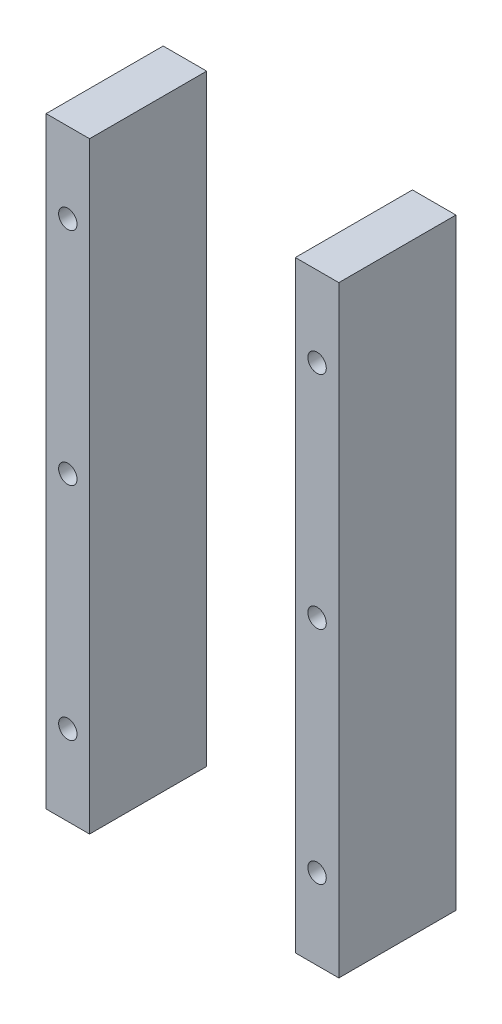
from build123d import *

# Parameters (mm, degrees)
CROQUIS1_W                = 26
CROQUIS1_H                = 360
SALIENTE_EXTRUIR1_DEPTH   = 70
SALIENTE_EXTRUIR1_2_DEPTH = 70
CROQUIS2_R                = 5.5
CORTAR_EXTRUIR1_DEPTH     = 253.079352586


with BuildPart() as part:
    # Croquis1 → Saliente-Extruir1 (new body)
    with BuildSketch(Plane.XY):
        Rectangle(CROQUIS1_W, CROQUIS1_H)
    extrude(amount=SALIENTE_EXTRUIR1_DEPTH)


with BuildPart() as body_2:
    # Croquis1 → Saliente-Extruir1 2 (new body)
    with BuildSketch(Plane.XY):
        with Locations((149, 0)):
            Rectangle(CROQUIS1_W, CROQUIS1_H)
    extrude(amount=SALIENTE_EXTRUIR1_2_DEPTH)


with BuildPart() as cortar_extruir1_tool:
    # Croquis2 → Cortar-Extruir1 (new, through all)
    with BuildSketch(Plane.XY.offset(70)):
        with Locations((0, 132)):
            Circle(CROQUIS2_R)
        Circle(CROQUIS2_R)
        with Locations(Location((0, -132, 0), (0, 0, 180))):
            Circle(CROQUIS2_R)
        with Locations((149, -132)):
            Circle(CROQUIS2_R)
        with Locations(Location((149, 0, 0), (0, 0, 180))):
            Circle(CROQUIS2_R)
        with Locations(Location((149, 132, 0), (0, 0, 180))):
            Circle(CROQUIS2_R)
    extrude(amount=-CORTAR_EXTRUIR1_DEPTH)


with BuildPart() as part_1:
    add(part.part)

    # Cortar-Extruir1: cut by cortar_extruir1_tool
    add(cortar_extruir1_tool.part, mode=Mode.SUBTRACT)


with BuildPart() as body_2_1:
    add(body_2.part)

    # Cortar-Extruir1: cut by cortar_extruir1_tool
    add(cortar_extruir1_tool.part, mode=Mode.SUBTRACT)


solid = Compound([part_1.part, body_2_1.part])
